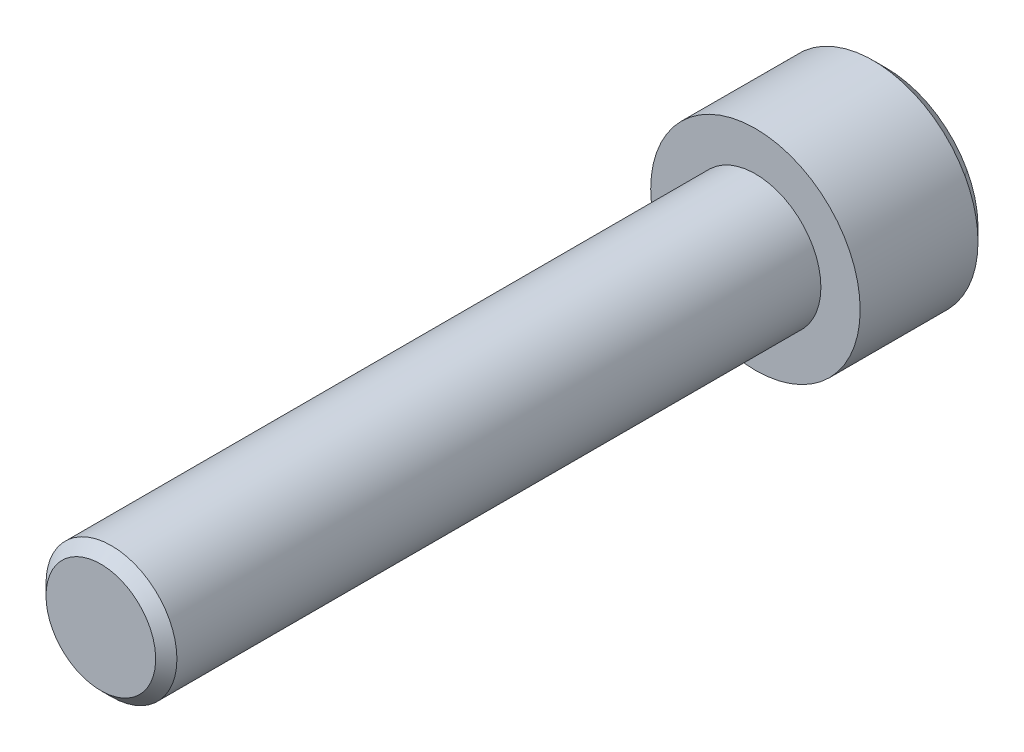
ISO-10303-21;
HEADER;
FILE_DESCRIPTION(('STEP AP214'),'2;1');
FILE_NAME('part.step','',(''),(''),'','','');
FILE_SCHEMA(('AUTOMOTIVE_DESIGN { 1 0 10303 214 1 1 1 1 }'));
ENDSEC;
DATA;
#1=APPLICATION_CONTEXT('core data for automotive mechanical design processes');
#2=APPLICATION_PROTOCOL_DEFINITION('international standard','automotive_design',2000,#1);
#3=PRODUCT_CONTEXT('',#1,'mechanical');
#4=PRODUCT('Part','Part','',(#3));
#5=PRODUCT_RELATED_PRODUCT_CATEGORY('part','',(#4));
#6=PRODUCT_DEFINITION_FORMATION('','',#4);
#7=PRODUCT_DEFINITION_CONTEXT('part definition',#1,'design');
#8=PRODUCT_DEFINITION('design','',#6,#7);
#9=PRODUCT_DEFINITION_SHAPE('','',#8);
#10=(LENGTH_UNIT() NAMED_UNIT(*) SI_UNIT(.MILLI.,.METRE.));
#11=(NAMED_UNIT(*) PLANE_ANGLE_UNIT() SI_UNIT($,.RADIAN.));
#12=(NAMED_UNIT(*) SI_UNIT($,.STERADIAN.) SOLID_ANGLE_UNIT());
#13=UNCERTAINTY_MEASURE_WITH_UNIT(LENGTH_MEASURE(1.E-05),#10,'distance_accuracy_value','');
#14=(GEOMETRIC_REPRESENTATION_CONTEXT(3) GLOBAL_UNCERTAINTY_ASSIGNED_CONTEXT((#13)) GLOBAL_UNIT_ASSIGNED_CONTEXT((#10,
#11,#12)) REPRESENTATION_CONTEXT('',''));
#15=CARTESIAN_POINT('',(0.,0.,0.));
#16=DIRECTION('',(0.,0.,1.));
#17=DIRECTION('',(1.,0.,0.));
#18=AXIS2_PLACEMENT_3D('',#15,#16,#17);
#19=CARTESIAN_POINT('',(0.,0.,5.));
#20=DIRECTION('',(0.,0.,-1.));
#21=DIRECTION('',(-1.,0.,0.));
#22=AXIS2_PLACEMENT_3D('',#19,#20,#21);
#23=PLANE('',#22);
#24=DIRECTION('',(0.50000000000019,-0.866025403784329,0.));
#25=VECTOR('',#24,1.);
#26=CARTESIAN_POINT('',(2.30940107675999,3.99999999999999,5.));
#27=LINE('',#26,#25);
#28=CARTESIAN_POINT('',(4.61880215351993,0.,5.));
#29=VERTEX_POINT('',#28);
#30=CARTESIAN_POINT('',(2.30940107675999,3.99999999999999,5.));
#31=VERTEX_POINT('',#30);
#32=EDGE_CURVE('E88',#29,#31,#27,.F.);
#33=ORIENTED_EDGE('',*,*,#32,.F.);
#34=DIRECTION('',(-0.50000000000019,-0.866025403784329,0.));
#35=VECTOR('',#34,1.);
#36=CARTESIAN_POINT('',(4.61880215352,0.,5.));
#37=LINE('',#36,#35);
#38=CARTESIAN_POINT('',(2.30940107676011,-4.00000000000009,5.));
#39=VERTEX_POINT('',#38);
#40=EDGE_CURVE('E96',#39,#29,#37,.F.);
#41=ORIENTED_EDGE('',*,*,#40,.F.);
#42=DIRECTION('',(-1.,0.,0.));
#43=VECTOR('',#42,1.);
#44=CARTESIAN_POINT('',(2.30940107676,-4.00000000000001,5.));
#45=LINE('',#44,#43);
#46=CARTESIAN_POINT('',(-2.30940107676,-4.,5.));
#47=VERTEX_POINT('',#46);
#48=EDGE_CURVE('E95',#47,#39,#45,.F.);
#49=ORIENTED_EDGE('',*,*,#48,.F.);
#50=DIRECTION('',(-0.50000000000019,0.866025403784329,0.));
#51=VECTOR('',#50,1.);
#52=CARTESIAN_POINT('',(-2.30940107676,-4.,5.));
#53=LINE('',#52,#51);
#54=CARTESIAN_POINT('',(-4.61880215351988,0.,5.));
#55=VERTEX_POINT('',#54);
#56=EDGE_CURVE('E247',#55,#47,#53,.F.);
#57=ORIENTED_EDGE('',*,*,#56,.F.);
#58=DIRECTION('',(0.50000000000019,0.866025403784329,0.));
#59=VECTOR('',#58,1.);
#60=CARTESIAN_POINT('',(-4.61880215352,0.,5.));
#61=LINE('',#60,#59);
#62=CARTESIAN_POINT('',(-2.30940107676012,4.00000000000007,5.));
#63=VERTEX_POINT('',#62);
#64=EDGE_CURVE('E243',#63,#55,#61,.F.);
#65=ORIENTED_EDGE('',*,*,#64,.F.);
#66=DIRECTION('',(1.,0.,0.));
#67=VECTOR('',#66,1.);
#68=CARTESIAN_POINT('',(-2.30940107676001,4.,5.));
#69=LINE('',#68,#67);
#70=EDGE_CURVE('E228',#31,#63,#69,.F.);
#71=ORIENTED_EDGE('',*,*,#70,.F.);
#72=EDGE_LOOP('',(#33,#41,#49,#57,#65,#71));
#73=FACE_BOUND('',#72,.T.);
#74=ADVANCED_FACE('F16',(#73),#23,.T.);
#75=CARTESIAN_POINT('',(4.61880215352,0.,0.));
#76=DIRECTION('',(-0.866025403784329,0.50000000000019,0.));
#77=DIRECTION('',(-0.50000000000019,-0.866025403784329,0.));
#78=AXIS2_PLACEMENT_3D('',#75,#76,#77);
#79=PLANE('',#78);
#80=DIRECTION('',(0.,0.,1.));
#81=VECTOR('',#80,1.);
#82=CARTESIAN_POINT('',(2.30940107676,-4.00000000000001,0.));
#83=LINE('',#82,#81);
#84=CARTESIAN_POINT('',(2.30940107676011,-4.00000000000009,0.));
#85=VERTEX_POINT('',#84);
#86=EDGE_CURVE('E79',#39,#85,#83,.F.);
#87=ORIENTED_EDGE('',*,*,#86,.F.);
#88=ORIENTED_EDGE('',*,*,#40,.T.);
#89=DIRECTION('',(0.,0.,1.));
#90=VECTOR('',#89,1.);
#91=CARTESIAN_POINT('',(4.61880215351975,-1.45716771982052E-13,0.));
#92=LINE('',#91,#90);
#93=CARTESIAN_POINT('',(4.61880215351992,0.,0.));
#94=VERTEX_POINT('',#93);
#95=EDGE_CURVE('E82',#94,#29,#92,.T.);
#96=ORIENTED_EDGE('',*,*,#95,.F.);
#97=DIRECTION('',(-0.500000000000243,-0.866025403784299,0.));
#98=VECTOR('',#97,1.);
#99=CARTESIAN_POINT('',(4.61880215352,0.,0.));
#100=LINE('',#99,#98);
#101=EDGE_CURVE('E74',#94,#85,#100,.T.);
#102=ORIENTED_EDGE('',*,*,#101,.T.);
#103=EDGE_LOOP('',(#87,#88,#96,#102));
#104=FACE_BOUND('',#103,.T.);
#105=ADVANCED_FACE('F76',(#104),#79,.T.);
#106=CARTESIAN_POINT('',(2.30940107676,-4.00000000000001,0.));
#107=DIRECTION('',(0.,1.,0.));
#108=DIRECTION('',(-1.,0.,0.));
#109=AXIS2_PLACEMENT_3D('',#106,#107,#108);
#110=PLANE('',#109);
#111=DIRECTION('',(0.,0.,1.));
#112=VECTOR('',#111,1.);
#113=CARTESIAN_POINT('',(-2.30940107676,-4.,0.));
#114=LINE('',#113,#112);
#115=CARTESIAN_POINT('',(-2.30940107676,-4.,0.));
#116=VERTEX_POINT('',#115);
#117=EDGE_CURVE('E249',#47,#116,#114,.F.);
#118=ORIENTED_EDGE('',*,*,#117,.F.);
#119=ORIENTED_EDGE('',*,*,#48,.T.);
#120=ORIENTED_EDGE('',*,*,#86,.T.);
#121=DIRECTION('',(1.,0.,0.));
#122=VECTOR('',#121,1.);
#123=CARTESIAN_POINT('',(0.,-4.,0.));
#124=LINE('',#123,#122);
#125=EDGE_CURVE('E87',#85,#116,#124,.F.);
#126=ORIENTED_EDGE('',*,*,#125,.T.);
#127=EDGE_LOOP('',(#118,#119,#120,#126));
#128=FACE_BOUND('',#127,.T.);
#129=ADVANCED_FACE('F92',(#128),#110,.T.);
#130=CARTESIAN_POINT('',(-2.30940107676,-4.,0.));
#131=DIRECTION('',(0.866025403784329,0.50000000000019,0.));
#132=DIRECTION('',(-0.50000000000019,0.866025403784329,0.));
#133=AXIS2_PLACEMENT_3D('',#130,#131,#132);
#134=PLANE('',#133);
#135=DIRECTION('',(0.,0.,1.));
#136=VECTOR('',#135,1.);
#137=CARTESIAN_POINT('',(-4.61880215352,0.,0.));
#138=LINE('',#137,#136);
#139=CARTESIAN_POINT('',(-4.61880215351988,0.,0.));
#140=VERTEX_POINT('',#139);
#141=EDGE_CURVE('E242',#55,#140,#138,.F.);
#142=ORIENTED_EDGE('',*,*,#141,.F.);
#143=ORIENTED_EDGE('',*,*,#56,.T.);
#144=ORIENTED_EDGE('',*,*,#117,.T.);
#145=DIRECTION('',(-0.500000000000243,0.866025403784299,0.));
#146=VECTOR('',#145,1.);
#147=CARTESIAN_POINT('',(-2.30940107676,-4.,0.));
#148=LINE('',#147,#146);
#149=EDGE_CURVE('E101',#116,#140,#148,.T.);
#150=ORIENTED_EDGE('',*,*,#149,.T.);
#151=EDGE_LOOP('',(#142,#143,#144,#150));
#152=FACE_BOUND('',#151,.T.);
#153=ADVANCED_FACE('F209',(#152),#134,.T.);
#154=CARTESIAN_POINT('',(-4.61880215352,0.,0.));
#155=DIRECTION('',(0.866025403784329,-0.50000000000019,0.));
#156=DIRECTION('',(0.50000000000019,0.866025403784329,0.));
#157=AXIS2_PLACEMENT_3D('',#154,#155,#156);
#158=PLANE('',#157);
#159=DIRECTION('',(0.,0.,-1.));
#160=VECTOR('',#159,1.);
#161=CARTESIAN_POINT('',(-2.30940107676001,4.,0.));
#162=LINE('',#161,#160);
#163=CARTESIAN_POINT('',(-2.30940107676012,4.00000000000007,0.));
#164=VERTEX_POINT('',#163);
#165=EDGE_CURVE('E240',#63,#164,#162,.T.);
#166=ORIENTED_EDGE('',*,*,#165,.F.);
#167=ORIENTED_EDGE('',*,*,#64,.T.);
#168=ORIENTED_EDGE('',*,*,#141,.T.);
#169=DIRECTION('',(0.500000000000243,0.866025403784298,0.));
#170=VECTOR('',#169,1.);
#171=CARTESIAN_POINT('',(-4.61880215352,0.,0.));
#172=LINE('',#171,#170);
#173=EDGE_CURVE('E103',#140,#164,#172,.T.);
#174=ORIENTED_EDGE('',*,*,#173,.T.);
#175=EDGE_LOOP('',(#166,#167,#168,#174));
#176=FACE_BOUND('',#175,.T.);
#177=ADVANCED_FACE('F206',(#176),#158,.T.);
#178=CARTESIAN_POINT('',(-2.30940107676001,4.,0.));
#179=DIRECTION('',(0.,-1.,0.));
#180=DIRECTION('',(0.,0.,-1.));
#181=AXIS2_PLACEMENT_3D('',#178,#179,#180);
#182=PLANE('',#181);
#183=DIRECTION('',(0.,0.,1.));
#184=VECTOR('',#183,1.);
#185=CARTESIAN_POINT('',(2.30940107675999,3.99999999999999,0.));
#186=LINE('',#185,#184);
#187=CARTESIAN_POINT('',(2.30940107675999,3.99999999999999,0.));
#188=VERTEX_POINT('',#187);
#189=EDGE_CURVE('E230',#31,#188,#186,.F.);
#190=ORIENTED_EDGE('',*,*,#189,.F.);
#191=ORIENTED_EDGE('',*,*,#70,.T.);
#192=ORIENTED_EDGE('',*,*,#165,.T.);
#193=DIRECTION('',(1.,0.,0.));
#194=VECTOR('',#193,1.);
#195=CARTESIAN_POINT('',(0.,4.,0.));
#196=LINE('',#195,#194);
#197=EDGE_CURVE('E52',#164,#188,#196,.T.);
#198=ORIENTED_EDGE('',*,*,#197,.T.);
#199=EDGE_LOOP('',(#190,#191,#192,#198));
#200=FACE_BOUND('',#199,.T.);
#201=ADVANCED_FACE('F200',(#200),#182,.T.);
#202=CARTESIAN_POINT('',(2.30940107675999,3.99999999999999,0.));
#203=DIRECTION('',(-0.866025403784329,-0.50000000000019,0.));
#204=DIRECTION('',(0.50000000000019,-0.866025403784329,0.));
#205=AXIS2_PLACEMENT_3D('',#202,#203,#204);
#206=PLANE('',#205);
#207=ORIENTED_EDGE('',*,*,#95,.T.);
#208=ORIENTED_EDGE('',*,*,#32,.T.);
#209=ORIENTED_EDGE('',*,*,#189,.T.);
#210=DIRECTION('',(0.500000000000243,-0.866025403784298,0.));
#211=VECTOR('',#210,1.);
#212=CARTESIAN_POINT('',(2.30940107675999,3.99999999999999,0.));
#213=LINE('',#212,#211);
#214=EDGE_CURVE('E144',#188,#94,#213,.T.);
#215=ORIENTED_EDGE('',*,*,#214,.T.);
#216=EDGE_LOOP('',(#207,#208,#209,#215));
#217=FACE_BOUND('',#216,.T.);
#218=ADVANCED_FACE('F160',(#217),#206,.T.);
#219=CARTESIAN_POINT('',(0.,0.,0.));
#220=DIRECTION('',(0.,0.,1.));
#221=DIRECTION('',(1.,0.,0.));
#222=AXIS2_PLACEMENT_3D('',#219,#220,#221);
#223=PLANE('',#222);
#224=ORIENTED_EDGE('',*,*,#197,.F.);
#225=ORIENTED_EDGE('',*,*,#173,.F.);
#226=ORIENTED_EDGE('',*,*,#149,.F.);
#227=ORIENTED_EDGE('',*,*,#125,.F.);
#228=ORIENTED_EDGE('',*,*,#101,.F.);
#229=ORIENTED_EDGE('',*,*,#214,.F.);
#230=EDGE_LOOP('',(#224,#225,#226,#227,#228,#229));
#231=FACE_BOUND('',#230,.T.);
#232=CARTESIAN_POINT('',(0.,0.,5.654504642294E-11));
#233=DIRECTION('',(0.,0.,1.));
#234=DIRECTION('',(0.,-1.,0.));
#235=AXIS2_PLACEMENT_3D('',#232,#233,#234);
#236=CIRCLE('',#235,6.99999999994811);
#237=CARTESIAN_POINT('',(6.14307793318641,3.3559787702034,9.86710713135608E-12));
#238=VERTEX_POINT('',#237);
#239=CARTESIAN_POINT('',(-6.1430779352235,-3.3559787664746,1.0019762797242E-11));
#240=VERTEX_POINT('',#239);
#241=EDGE_CURVE('E137',#238,#240,#236,.T.);
#242=ORIENTED_EDGE('',*,*,#241,.F.);
#243=CARTESIAN_POINT('',(0.,0.,2.0046464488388E-11));
#244=DIRECTION('',(0.,0.,1.));
#245=DIRECTION('',(0.,-1.,0.));
#246=AXIS2_PLACEMENT_3D('',#243,#244,#245);
#247=CIRCLE('',#246,6.9999999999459);
#248=EDGE_CURVE('E20',#240,#238,#247,.T.);
#249=ORIENTED_EDGE('',*,*,#248,.F.);
#250=EDGE_LOOP('',(#242,#249));
#251=FACE_BOUND('',#250,.T.);
#252=ADVANCED_FACE('F99',(#231,#251),#223,.F.);
#253=CARTESIAN_POINT('',(0.,0.,0.999999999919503));
#254=DIRECTION('',(0.,0.,1.));
#255=DIRECTION('',(0.,-1.,0.));
#256=AXIS2_PLACEMENT_3D('',#253,#254,#255);
#257=CONICAL_SURFACE('',#256,7.99999999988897,0.785398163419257);
#258=DIRECTION('',(-0.620544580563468,-0.33900504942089,-0.707106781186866));
#259=VECTOR('',#258,1.);
#260=CARTESIAN_POINT('',(437919.841460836,239236.699742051,499000.));
#261=LINE('',#260,#259);
#262=CARTESIAN_POINT('',(7.02066049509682,3.83540430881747,0.999999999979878));
#263=VERTEX_POINT('',#262);
#264=EDGE_CURVE('E35',#263,#238,#261,.T.);
#265=ORIENTED_EDGE('',*,*,#264,.F.);
#266=CARTESIAN_POINT('',(0.,0.,1.));
#267=DIRECTION('',(0.,0.,1.));
#268=DIRECTION('',(1.,0.,0.));
#269=AXIS2_PLACEMENT_3D('',#266,#267,#268);
#270=CIRCLE('',#269,8.);
#271=CARTESIAN_POINT('',(-7.02066049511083,-3.83540430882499,1.00000000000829));
#272=VERTEX_POINT('',#271);
#273=EDGE_CURVE('E141',#272,#263,#270,.T.);
#274=ORIENTED_EDGE('',*,*,#273,.F.);
#275=CARTESIAN_POINT('',(-6.14307793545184,-3.35597876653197,0.));
#276=CARTESIAN_POINT('',(-6.17964387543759,-3.37595483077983,0.041666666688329));
#277=CARTESIAN_POINT('',(-6.21620981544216,-3.39593089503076,0.0833333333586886));
#278=CARTESIAN_POINT('',(-6.28934169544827,-3.4358830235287,0.16666666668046));
#279=CARTESIAN_POINT('',(-6.32590763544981,-3.4558590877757,0.208333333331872));
#280=CARTESIAN_POINT('',(-6.39903951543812,-3.49581121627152,0.29166666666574));
#281=CARTESIAN_POINT('',(-6.43560545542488,-3.51578728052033,0.333333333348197));
#282=CARTESIAN_POINT('',(-6.50873733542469,-3.55573940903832,0.416666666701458));
#283=CARTESIAN_POINT('',(-6.54530327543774,-3.57571547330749,0.458333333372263));
#284=CARTESIAN_POINT('',(-6.61843515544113,-3.61566760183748,0.541666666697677));
#285=CARTESIAN_POINT('',(-6.65500109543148,-3.6356436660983,0.583333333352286));
#286=CARTESIAN_POINT('',(-6.72813297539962,-3.67559579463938,0.666666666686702));
#287=CARTESIAN_POINT('',(-6.7646989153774,-3.69557185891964,0.708333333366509));
#288=CARTESIAN_POINT('',(-6.83783079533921,-3.73552398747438,0.791666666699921));
#289=CARTESIAN_POINT('',(-6.87439673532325,-3.75550005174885,0.833333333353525));
#290=CARTESIAN_POINT('',(-6.94752861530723,-3.79545218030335,0.916666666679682));
#291=CARTESIAN_POINT('',(-6.98409455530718,-3.81542824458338,0.958333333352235));
#292=CARTESIAN_POINT('',(-7.02066049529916,-3.8354043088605,1.00000000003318));
#293=B_SPLINE_CURVE_WITH_KNOTS('',3,(#275,#276,#277,#278,#279,#280,#281,#282,#283,#284,#285,
#286,#287,#288,#289,#290,#291,#292),.UNSPECIFIED.,.F.,.F.,(4,2,2,2,2,2,2,2,4),(0.,
0.176776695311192,0.353553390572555,0.530330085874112,0.707106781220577,0.88388347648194,
1.06066017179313,1.2374368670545,1.41421356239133),.UNSPECIFIED.);
#294=EDGE_CURVE('E122',#240,#272,#293,.T.);
#295=ORIENTED_EDGE('',*,*,#294,.F.);
#296=ORIENTED_EDGE('',*,*,#248,.T.);
#297=EDGE_LOOP('',(#265,#274,#295,#296));
#298=FACE_BOUND('',#297,.T.);
#299=ADVANCED_FACE('F113',(#298),#257,.T.);
#300=CARTESIAN_POINT('',(0.,0.,1.00000000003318));
#301=DIRECTION('',(0.,0.,1.));
#302=DIRECTION('',(0.,-1.,0.));
#303=AXIS2_PLACEMENT_3D('',#300,#301,#302);
#304=CONICAL_SURFACE('',#303,7.9999999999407,0.78539816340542);
#305=ORIENTED_EDGE('',*,*,#294,.T.);
#306=CARTESIAN_POINT('',(0.,0.,1.));
#307=DIRECTION('',(0.,0.,1.));
#308=DIRECTION('',(1.,0.,0.));
#309=AXIS2_PLACEMENT_3D('',#306,#307,#308);
#310=CIRCLE('',#309,8.);
#311=EDGE_CURVE('E136',#263,#272,#310,.T.);
#312=ORIENTED_EDGE('',*,*,#311,.F.);
#313=ORIENTED_EDGE('',*,*,#264,.T.);
#314=ORIENTED_EDGE('',*,*,#241,.T.);
#315=EDGE_LOOP('',(#305,#312,#313,#314));
#316=FACE_BOUND('',#315,.T.);
#317=ADVANCED_FACE('F115',(#316),#304,.T.);
#318=CARTESIAN_POINT('',(0.,0.,30.));
#319=DIRECTION('',(0.,0.,1.));
#320=DIRECTION('',(1.,0.,0.));
#321=AXIS2_PLACEMENT_3D('',#318,#319,#320);
#322=CYLINDRICAL_SURFACE('',#321,8.);
#323=CARTESIAN_POINT('',(0.,0.,10.));
#324=DIRECTION('',(0.,0.,1.));
#325=DIRECTION('',(1.,0.,0.));
#326=AXIS2_PLACEMENT_3D('',#323,#324,#325);
#327=CIRCLE('',#326,8.);
#328=CARTESIAN_POINT('',(7.99999999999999,0.,10.));
#329=VERTEX_POINT('',#328);
#330=EDGE_CURVE('E134',#329,#329,#327,.T.);
#331=ORIENTED_EDGE('',*,*,#330,.F.);
#332=EDGE_LOOP('',(#331));
#333=FACE_BOUND('',#332,.T.);
#334=ORIENTED_EDGE('',*,*,#311,.T.);
#335=ORIENTED_EDGE('',*,*,#273,.T.);
#336=EDGE_LOOP('',(#334,#335));
#337=FACE_BOUND('',#336,.T.);
#338=ADVANCED_FACE('F153',(#333,#337),#322,.T.);
#339=CARTESIAN_POINT('',(4.18799999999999,0.,60.));
#340=DIRECTION('',(0.,0.,1.));
#341=DIRECTION('',(1.,0.,0.));
#342=AXIS2_PLACEMENT_3D('',#339,#340,#341);
#343=PLANE('',#342);
#344=CARTESIAN_POINT('',(0.,0.,59.9999999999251));
#345=DIRECTION('',(0.,0.,-1.));
#346=DIRECTION('',(-1.,0.,0.));
#347=AXIS2_PLACEMENT_3D('',#344,#345,#346);
#348=CIRCLE('',#347,4.18800000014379);
#349=CARTESIAN_POINT('',(-4.18800000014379,0.,59.9999999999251));
#350=VERTEX_POINT('',#349);
#351=EDGE_CURVE('E131',#350,#350,#348,.T.);
#352=ORIENTED_EDGE('',*,*,#351,.F.);
#353=EDGE_LOOP('',(#352));
#354=FACE_BOUND('',#353,.T.);
#355=ADVANCED_FACE('F175',(#354),#343,.T.);
#356=CARTESIAN_POINT('',(8.,0.,10.));
#357=DIRECTION('',(0.,0.,1.));
#358=DIRECTION('',(1.,0.,0.));
#359=AXIS2_PLACEMENT_3D('',#356,#357,#358);
#360=PLANE('',#359);
#361=CARTESIAN_POINT('',(0.,0.,10.));
#362=DIRECTION('',(0.,0.,1.));
#363=DIRECTION('',(1.,0.,0.));
#364=AXIS2_PLACEMENT_3D('',#361,#362,#363);
#365=CIRCLE('',#364,5.);
#366=CARTESIAN_POINT('',(4.99999999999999,0.,10.));
#367=VERTEX_POINT('',#366);
#368=EDGE_CURVE('E26',#367,#367,#365,.T.);
#369=ORIENTED_EDGE('',*,*,#368,.F.);
#370=EDGE_LOOP('',(#369));
#371=FACE_BOUND('',#370,.T.);
#372=ORIENTED_EDGE('',*,*,#330,.T.);
#373=EDGE_LOOP('',(#372));
#374=FACE_BOUND('',#373,.T.);
#375=ADVANCED_FACE('F167',(#371,#374),#360,.T.);
#376=CARTESIAN_POINT('',(0.,0.,59.1879999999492));
#377=DIRECTION('',(0.,0.,-1.));
#378=DIRECTION('',(-1.,0.,0.));
#379=AXIS2_PLACEMENT_3D('',#376,#377,#378);
#380=CONICAL_SURFACE('',#379,5.00000000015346,0.785398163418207);
#381=ORIENTED_EDGE('',*,*,#351,.T.);
#382=EDGE_LOOP('',(#381));
#383=FACE_BOUND('',#382,.T.);
#384=CARTESIAN_POINT('',(0.,0.,59.188));
#385=DIRECTION('',(0.,0.,1.));
#386=DIRECTION('',(1.,0.,0.));
#387=AXIS2_PLACEMENT_3D('',#384,#385,#386);
#388=CIRCLE('',#387,5.);
#389=CARTESIAN_POINT('',(4.99999999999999,0.,59.188));
#390=VERTEX_POINT('',#389);
#391=EDGE_CURVE('E11',#390,#390,#388,.F.);
#392=ORIENTED_EDGE('',*,*,#391,.F.);
#393=EDGE_LOOP('',(#392));
#394=FACE_BOUND('',#393,.T.);
#395=ADVANCED_FACE('F162',(#383,#394),#380,.T.);
#396=CARTESIAN_POINT('',(0.,0.,30.));
#397=DIRECTION('',(0.,0.,1.));
#398=DIRECTION('',(1.,0.,0.));
#399=AXIS2_PLACEMENT_3D('',#396,#397,#398);
#400=CYLINDRICAL_SURFACE('',#399,5.);
#401=ORIENTED_EDGE('',*,*,#391,.T.);
#402=EDGE_LOOP('',(#401));
#403=FACE_BOUND('',#402,.T.);
#404=ORIENTED_EDGE('',*,*,#368,.T.);
#405=EDGE_LOOP('',(#404));
#406=FACE_BOUND('',#405,.T.);
#407=ADVANCED_FACE('F18',(#403,#406),#400,.T.);
#408=CLOSED_SHELL('',(#74,#105,#129,#153,#177,#201,#218,#252,#299,#317,#338,#355,#375,#395,#407));
#409=MANIFOLD_SOLID_BREP('B1',#408);
#410=ADVANCED_BREP_SHAPE_REPRESENTATION('',(#18,#409),#14);
#411=SHAPE_DEFINITION_REPRESENTATION(#9,#410);
ENDSEC;
END-ISO-10303-21;
